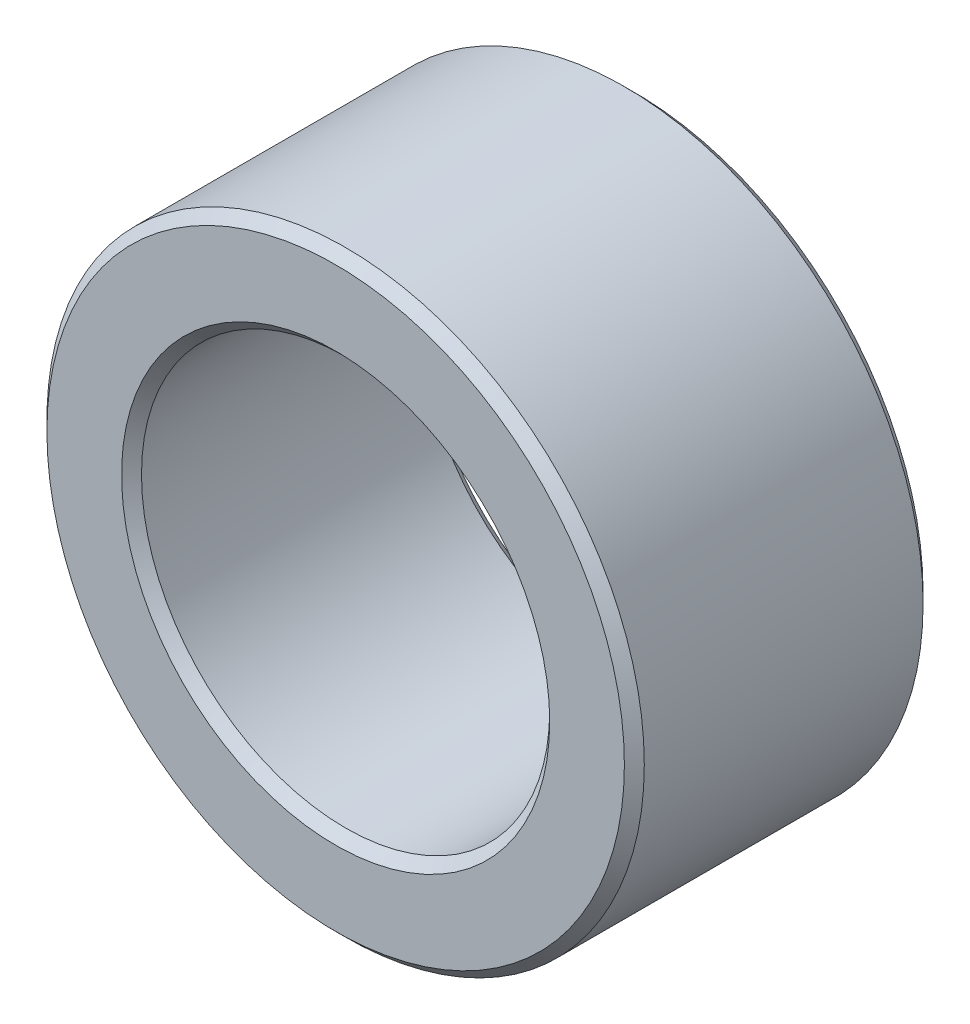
ISO-10303-21;
HEADER;
FILE_DESCRIPTION(('STEP AP214'),'2;1');
FILE_NAME('part.step','',(''),(''),'','','');
FILE_SCHEMA(('AUTOMOTIVE_DESIGN { 1 0 10303 214 1 1 1 1 }'));
ENDSEC;
DATA;
#1=APPLICATION_CONTEXT('core data for automotive mechanical design processes');
#2=APPLICATION_PROTOCOL_DEFINITION('international standard','automotive_design',2000,#1);
#3=PRODUCT_CONTEXT('',#1,'mechanical');
#4=PRODUCT('Part','Part','',(#3));
#5=PRODUCT_RELATED_PRODUCT_CATEGORY('part','',(#4));
#6=PRODUCT_DEFINITION_FORMATION('','',#4);
#7=PRODUCT_DEFINITION_CONTEXT('part definition',#1,'design');
#8=PRODUCT_DEFINITION('design','',#6,#7);
#9=PRODUCT_DEFINITION_SHAPE('','',#8);
#10=(LENGTH_UNIT() NAMED_UNIT(*) SI_UNIT(.MILLI.,.METRE.));
#11=(NAMED_UNIT(*) PLANE_ANGLE_UNIT() SI_UNIT($,.RADIAN.));
#12=(NAMED_UNIT(*) SI_UNIT($,.STERADIAN.) SOLID_ANGLE_UNIT());
#13=UNCERTAINTY_MEASURE_WITH_UNIT(LENGTH_MEASURE(1.E-05),#10,'distance_accuracy_value','');
#14=(GEOMETRIC_REPRESENTATION_CONTEXT(3) GLOBAL_UNCERTAINTY_ASSIGNED_CONTEXT((#13)) GLOBAL_UNIT_ASSIGNED_CONTEXT((#10,
#11,#12)) REPRESENTATION_CONTEXT('',''));
#15=CARTESIAN_POINT('',(0.,0.,0.));
#16=DIRECTION('',(0.,0.,1.));
#17=DIRECTION('',(1.,0.,0.));
#18=AXIS2_PLACEMENT_3D('',#15,#16,#17);
#19=CARTESIAN_POINT('',(0.,0.,3.));
#20=DIRECTION('',(0.,0.,1.));
#21=DIRECTION('',(1.,0.,0.));
#22=AXIS2_PLACEMENT_3D('',#19,#20,#21);
#23=PLANE('',#22);
#24=CARTESIAN_POINT('',(0.,0.,3.));
#25=DIRECTION('',(0.,0.,1.));
#26=DIRECTION('',(1.,0.,0.));
#27=AXIS2_PLACEMENT_3D('',#24,#25,#26);
#28=CIRCLE('',#27,4.3);
#29=CARTESIAN_POINT('',(4.3,0.,3.));
#30=VERTEX_POINT('',#29);
#31=EDGE_CURVE('E10',#30,#30,#28,.F.);
#32=ORIENTED_EDGE('',*,*,#31,.T.);
#33=EDGE_LOOP('',(#32));
#34=FACE_BOUND('',#33,.T.);
#35=CARTESIAN_POINT('',(0.,0.,3.));
#36=DIRECTION('',(0.,0.,1.));
#37=DIRECTION('',(1.,0.,0.));
#38=AXIS2_PLACEMENT_3D('',#35,#36,#37);
#39=CIRCLE('',#38,5.8);
#40=CARTESIAN_POINT('',(5.8,0.,3.));
#41=VERTEX_POINT('',#40);
#42=EDGE_CURVE('E45',#41,#41,#39,.T.);
#43=ORIENTED_EDGE('',*,*,#42,.T.);
#44=EDGE_LOOP('',(#43));
#45=FACE_BOUND('',#44,.T.);
#46=ADVANCED_FACE('F37',(#34,#45),#23,.T.);
#47=CARTESIAN_POINT('',(0.,0.,-3.));
#48=DIRECTION('',(0.,0.,1.));
#49=DIRECTION('',(1.,0.,0.));
#50=AXIS2_PLACEMENT_3D('',#47,#48,#49);
#51=PLANE('',#50);
#52=CARTESIAN_POINT('',(0.,0.,-3.));
#53=DIRECTION('',(0.,0.,1.));
#54=DIRECTION('',(1.,0.,0.));
#55=AXIS2_PLACEMENT_3D('',#52,#53,#54);
#56=CIRCLE('',#55,5.8);
#57=CARTESIAN_POINT('',(5.8,0.,-3.));
#58=VERTEX_POINT('',#57);
#59=EDGE_CURVE('E63',#58,#58,#56,.F.);
#60=ORIENTED_EDGE('',*,*,#59,.T.);
#61=EDGE_LOOP('',(#60));
#62=FACE_BOUND('',#61,.T.);
#63=CARTESIAN_POINT('',(0.,0.,-3.));
#64=DIRECTION('',(0.,0.,1.));
#65=DIRECTION('',(1.,0.,0.));
#66=AXIS2_PLACEMENT_3D('',#63,#64,#65);
#67=CIRCLE('',#66,4.3);
#68=CARTESIAN_POINT('',(-4.3,0.,-3.));
#69=VERTEX_POINT('',#68);
#70=EDGE_CURVE('E67',#69,#69,#67,.T.);
#71=ORIENTED_EDGE('',*,*,#70,.T.);
#72=EDGE_LOOP('',(#71));
#73=FACE_BOUND('',#72,.T.);
#74=ADVANCED_FACE('F89',(#62,#73),#51,.F.);
#75=CARTESIAN_POINT('',(0.,0.,3.));
#76=DIRECTION('',(0.,0.,-1.));
#77=DIRECTION('',(-1.,0.,0.));
#78=AXIS2_PLACEMENT_3D('',#75,#76,#77);
#79=CYLINDRICAL_SURFACE('',#78,6.);
#80=CARTESIAN_POINT('',(0.,0.,-2.8));
#81=DIRECTION('',(0.,0.,1.));
#82=DIRECTION('',(1.,0.,0.));
#83=AXIS2_PLACEMENT_3D('',#80,#81,#82);
#84=CIRCLE('',#83,6.);
#85=CARTESIAN_POINT('',(6.,0.,-2.8));
#86=VERTEX_POINT('',#85);
#87=EDGE_CURVE('E70',#86,#86,#84,.T.);
#88=ORIENTED_EDGE('',*,*,#87,.T.);
#89=EDGE_LOOP('',(#88));
#90=FACE_BOUND('',#89,.T.);
#91=CARTESIAN_POINT('',(0.,0.,2.8));
#92=DIRECTION('',(0.,0.,1.));
#93=DIRECTION('',(1.,0.,0.));
#94=AXIS2_PLACEMENT_3D('',#91,#92,#93);
#95=CIRCLE('',#94,6.);
#96=CARTESIAN_POINT('',(6.,0.,2.8));
#97=VERTEX_POINT('',#96);
#98=EDGE_CURVE('E74',#97,#97,#95,.F.);
#99=ORIENTED_EDGE('',*,*,#98,.T.);
#100=EDGE_LOOP('',(#99));
#101=FACE_BOUND('',#100,.T.);
#102=ADVANCED_FACE('F78',(#90,#101),#79,.T.);
#103=CARTESIAN_POINT('',(0.,0.,3.));
#104=DIRECTION('',(0.,0.,-1.));
#105=DIRECTION('',(-1.,0.,0.));
#106=AXIS2_PLACEMENT_3D('',#103,#104,#105);
#107=CYLINDRICAL_SURFACE('',#106,4.1);
#108=CARTESIAN_POINT('',(0.,0.,-2.8));
#109=DIRECTION('',(0.,0.,1.));
#110=DIRECTION('',(1.,0.,0.));
#111=AXIS2_PLACEMENT_3D('',#108,#109,#110);
#112=CIRCLE('',#111,4.1);
#113=CARTESIAN_POINT('',(-4.1,0.,-2.8));
#114=VERTEX_POINT('',#113);
#115=EDGE_CURVE('E52',#114,#114,#112,.F.);
#116=CARTESIAN_POINT('',(0.,0.,2.8));
#117=DIRECTION('',(0.,0.,1.));
#118=DIRECTION('',(1.,0.,0.));
#119=AXIS2_PLACEMENT_3D('',#116,#117,#118);
#120=CIRCLE('',#119,4.1);
#121=CARTESIAN_POINT('',(-4.1,0.,2.8));
#122=VERTEX_POINT('',#121);
#123=EDGE_CURVE('E58',#122,#122,#120,.T.);
#124=CARTESIAN_POINT('',(-4.1,0.,-2.8));
#125=CARTESIAN_POINT('',(-4.1,0.,-2.74166666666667));
#126=CARTESIAN_POINT('',(-4.1,0.,-2.68333333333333));
#127=CARTESIAN_POINT('',(-4.1,0.,-2.56666666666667));
#128=CARTESIAN_POINT('',(-4.1,0.,-2.50833333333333));
#129=CARTESIAN_POINT('',(-4.1,0.,-2.39166666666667));
#130=CARTESIAN_POINT('',(-4.1,0.,-2.33333333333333));
#131=CARTESIAN_POINT('',(-4.1,0.,-2.21666666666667));
#132=CARTESIAN_POINT('',(-4.1,0.,-2.15833333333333));
#133=CARTESIAN_POINT('',(-4.1,0.,-2.04166666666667));
#134=CARTESIAN_POINT('',(-4.1,0.,-1.98333333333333));
#135=CARTESIAN_POINT('',(-4.1,0.,-1.86666666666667));
#136=CARTESIAN_POINT('',(-4.1,0.,-1.80833333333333));
#137=CARTESIAN_POINT('',(-4.1,0.,-1.69166666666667));
#138=CARTESIAN_POINT('',(-4.1,0.,-1.63333333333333));
#139=CARTESIAN_POINT('',(-4.1,0.,-1.51666666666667));
#140=CARTESIAN_POINT('',(-4.1,0.,-1.45833333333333));
#141=CARTESIAN_POINT('',(-4.1,0.,-1.34166666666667));
#142=CARTESIAN_POINT('',(-4.1,0.,-1.28333333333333));
#143=CARTESIAN_POINT('',(-4.1,0.,-1.16666666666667));
#144=CARTESIAN_POINT('',(-4.1,0.,-1.10833333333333));
#145=CARTESIAN_POINT('',(-4.1,0.,-0.991666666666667));
#146=CARTESIAN_POINT('',(-4.1,0.,-0.933333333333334));
#147=CARTESIAN_POINT('',(-4.1,0.,-0.816666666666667));
#148=CARTESIAN_POINT('',(-4.1,0.,-0.758333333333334));
#149=CARTESIAN_POINT('',(-4.1,0.,-0.641666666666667));
#150=CARTESIAN_POINT('',(-4.1,0.,-0.583333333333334));
#151=CARTESIAN_POINT('',(-4.1,0.,-0.466666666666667));
#152=CARTESIAN_POINT('',(-4.1,0.,-0.408333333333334));
#153=CARTESIAN_POINT('',(-4.1,0.,-0.291666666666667));
#154=CARTESIAN_POINT('',(-4.1,0.,-0.233333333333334));
#155=CARTESIAN_POINT('',(-4.1,0.,-0.116666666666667));
#156=CARTESIAN_POINT('',(-4.1,0.,-0.0583333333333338));
#157=CARTESIAN_POINT('',(-4.1,0.,0.058333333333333));
#158=CARTESIAN_POINT('',(-4.1,0.,0.116666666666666));
#159=CARTESIAN_POINT('',(-4.1,0.,0.233333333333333));
#160=CARTESIAN_POINT('',(-4.1,0.,0.291666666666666));
#161=CARTESIAN_POINT('',(-4.1,0.,0.408333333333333));
#162=CARTESIAN_POINT('',(-4.1,0.,0.466666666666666));
#163=CARTESIAN_POINT('',(-4.1,0.,0.583333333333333));
#164=CARTESIAN_POINT('',(-4.1,0.,0.641666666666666));
#165=CARTESIAN_POINT('',(-4.1,0.,0.758333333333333));
#166=CARTESIAN_POINT('',(-4.1,0.,0.816666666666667));
#167=CARTESIAN_POINT('',(-4.1,0.,0.933333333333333));
#168=CARTESIAN_POINT('',(-4.1,0.,0.991666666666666));
#169=CARTESIAN_POINT('',(-4.1,0.,1.10833333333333));
#170=CARTESIAN_POINT('',(-4.1,0.,1.16666666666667));
#171=CARTESIAN_POINT('',(-4.1,0.,1.28333333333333));
#172=CARTESIAN_POINT('',(-4.1,0.,1.34166666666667));
#173=CARTESIAN_POINT('',(-4.1,0.,1.45833333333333));
#174=CARTESIAN_POINT('',(-4.1,0.,1.51666666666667));
#175=CARTESIAN_POINT('',(-4.1,0.,1.63333333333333));
#176=CARTESIAN_POINT('',(-4.1,0.,1.69166666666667));
#177=CARTESIAN_POINT('',(-4.1,0.,1.80833333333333));
#178=CARTESIAN_POINT('',(-4.1,0.,1.86666666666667));
#179=CARTESIAN_POINT('',(-4.1,0.,1.98333333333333));
#180=CARTESIAN_POINT('',(-4.1,0.,2.04166666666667));
#181=CARTESIAN_POINT('',(-4.1,0.,2.15833333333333));
#182=CARTESIAN_POINT('',(-4.1,0.,2.21666666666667));
#183=CARTESIAN_POINT('',(-4.1,0.,2.33333333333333));
#184=CARTESIAN_POINT('',(-4.1,0.,2.39166666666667));
#185=CARTESIAN_POINT('',(-4.1,0.,2.50833333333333));
#186=CARTESIAN_POINT('',(-4.1,0.,2.56666666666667));
#187=CARTESIAN_POINT('',(-4.1,0.,2.68333333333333));
#188=CARTESIAN_POINT('',(-4.1,0.,2.74166666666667));
#189=CARTESIAN_POINT('',(-4.1,0.,2.8));
#190=B_SPLINE_CURVE_WITH_KNOTS('',3,(#124,#125,#126,#127,#128,#129,#130,#131,#132,#133,#134,
#135,#136,#137,#138,#139,#140,#141,#142,#143,#144,#145,#146,#147,#148,#149,#150,#151,#152,#153,
#154,#155,#156,#157,#158,#159,#160,#161,#162,#163,#164,#165,#166,#167,#168,#169,#170,#171,#172,
#173,#174,#175,#176,#177,#178,#179,#180,#181,#182,#183,#184,#185,#186,#187,#188,#189),
.UNSPECIFIED.,.F.,.F.,(4,2,2,2,2,2,2,2,2,2,2,2,2,2,2,2,2,2,2,2,2,2,2,2,2,2,2,2,2,2,2,2,4),(0.,
0.175,0.35,0.525,0.7,0.875,1.05,1.225,1.4,1.575,1.75,1.925,2.1,2.275,2.45,2.625,2.8,2.975,3.15,
3.325,3.5,3.675,3.85,4.025,4.2,4.375,4.55,4.725,4.9,5.075,5.25,5.425,5.6),.UNSPECIFIED.);
#191=EDGE_CURVE('BSEAM97',#114,#122,#190,.T.);
#192=ORIENTED_EDGE('',*,*,#115,.T.);
#193=ORIENTED_EDGE('',*,*,#123,.T.);
#194=ORIENTED_EDGE('',*,*,#191,.T.);
#195=ORIENTED_EDGE('',*,*,#191,.F.);
#196=EDGE_LOOP('',(#192,#194,#193,#195));
#197=FACE_BOUND('',#196,.T.);
#198=ADVANCED_FACE('F97',(#197),#107,.F.);
#199=CARTESIAN_POINT('',(0.,0.,-2.8));
#200=DIRECTION('',(0.,0.,1.));
#201=DIRECTION('',(1.,0.,0.));
#202=AXIS2_PLACEMENT_3D('',#199,#200,#201);
#203=CONICAL_SURFACE('',#202,6.,0.785398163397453);
#204=ORIENTED_EDGE('',*,*,#59,.F.);
#205=EDGE_LOOP('',(#204));
#206=FACE_BOUND('',#205,.T.);
#207=ORIENTED_EDGE('',*,*,#87,.F.);
#208=EDGE_LOOP('',(#207));
#209=FACE_BOUND('',#208,.T.);
#210=ADVANCED_FACE('F102',(#206,#209),#203,.T.);
#211=CARTESIAN_POINT('',(0.,0.,-3.));
#212=DIRECTION('',(0.,0.,-1.));
#213=DIRECTION('',(-1.,0.,0.));
#214=AXIS2_PLACEMENT_3D('',#211,#212,#213);
#215=CONICAL_SURFACE('',#214,4.3,0.785398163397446);
#216=CARTESIAN_POINT('',(-4.1,0.,-2.8));
#217=CARTESIAN_POINT('',(-4.10208333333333,0.,-2.80208333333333));
#218=CARTESIAN_POINT('',(-4.10416666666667,0.,-2.80416666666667));
#219=CARTESIAN_POINT('',(-4.10833333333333,0.,-2.80833333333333));
#220=CARTESIAN_POINT('',(-4.11041666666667,0.,-2.81041666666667));
#221=CARTESIAN_POINT('',(-4.11458333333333,0.,-2.81458333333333));
#222=CARTESIAN_POINT('',(-4.11666666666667,0.,-2.81666666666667));
#223=CARTESIAN_POINT('',(-4.12083333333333,0.,-2.82083333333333));
#224=CARTESIAN_POINT('',(-4.12291666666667,0.,-2.82291666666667));
#225=CARTESIAN_POINT('',(-4.12708333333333,0.,-2.82708333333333));
#226=CARTESIAN_POINT('',(-4.12916666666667,0.,-2.82916666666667));
#227=CARTESIAN_POINT('',(-4.13333333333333,0.,-2.83333333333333));
#228=CARTESIAN_POINT('',(-4.13541666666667,0.,-2.83541666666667));
#229=CARTESIAN_POINT('',(-4.13958333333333,0.,-2.83958333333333));
#230=CARTESIAN_POINT('',(-4.14166666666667,0.,-2.84166666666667));
#231=CARTESIAN_POINT('',(-4.14583333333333,0.,-2.84583333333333));
#232=CARTESIAN_POINT('',(-4.14791666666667,0.,-2.84791666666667));
#233=CARTESIAN_POINT('',(-4.15208333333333,0.,-2.85208333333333));
#234=CARTESIAN_POINT('',(-4.15416666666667,0.,-2.85416666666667));
#235=CARTESIAN_POINT('',(-4.15833333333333,0.,-2.85833333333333));
#236=CARTESIAN_POINT('',(-4.16041666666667,0.,-2.86041666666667));
#237=CARTESIAN_POINT('',(-4.16458333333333,0.,-2.86458333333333));
#238=CARTESIAN_POINT('',(-4.16666666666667,0.,-2.86666666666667));
#239=CARTESIAN_POINT('',(-4.17083333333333,0.,-2.87083333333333));
#240=CARTESIAN_POINT('',(-4.17291666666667,0.,-2.87291666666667));
#241=CARTESIAN_POINT('',(-4.17708333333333,0.,-2.87708333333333));
#242=CARTESIAN_POINT('',(-4.17916666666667,0.,-2.87916666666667));
#243=CARTESIAN_POINT('',(-4.18333333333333,0.,-2.88333333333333));
#244=CARTESIAN_POINT('',(-4.18541666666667,0.,-2.88541666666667));
#245=CARTESIAN_POINT('',(-4.18958333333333,0.,-2.88958333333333));
#246=CARTESIAN_POINT('',(-4.19166666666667,0.,-2.89166666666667));
#247=CARTESIAN_POINT('',(-4.19583333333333,0.,-2.89583333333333));
#248=CARTESIAN_POINT('',(-4.19791666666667,0.,-2.89791666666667));
#249=CARTESIAN_POINT('',(-4.20208333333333,0.,-2.90208333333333));
#250=CARTESIAN_POINT('',(-4.20416666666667,0.,-2.90416666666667));
#251=CARTESIAN_POINT('',(-4.20833333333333,0.,-2.90833333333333));
#252=CARTESIAN_POINT('',(-4.21041666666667,0.,-2.91041666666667));
#253=CARTESIAN_POINT('',(-4.21458333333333,0.,-2.91458333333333));
#254=CARTESIAN_POINT('',(-4.21666666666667,0.,-2.91666666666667));
#255=CARTESIAN_POINT('',(-4.22083333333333,0.,-2.92083333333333));
#256=CARTESIAN_POINT('',(-4.22291666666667,0.,-2.92291666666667));
#257=CARTESIAN_POINT('',(-4.22708333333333,0.,-2.92708333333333));
#258=CARTESIAN_POINT('',(-4.22916666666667,0.,-2.92916666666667));
#259=CARTESIAN_POINT('',(-4.23333333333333,0.,-2.93333333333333));
#260=CARTESIAN_POINT('',(-4.23541666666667,0.,-2.93541666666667));
#261=CARTESIAN_POINT('',(-4.23958333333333,0.,-2.93958333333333));
#262=CARTESIAN_POINT('',(-4.24166666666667,0.,-2.94166666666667));
#263=CARTESIAN_POINT('',(-4.24583333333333,0.,-2.94583333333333));
#264=CARTESIAN_POINT('',(-4.24791666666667,0.,-2.94791666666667));
#265=CARTESIAN_POINT('',(-4.25208333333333,0.,-2.95208333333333));
#266=CARTESIAN_POINT('',(-4.25416666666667,0.,-2.95416666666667));
#267=CARTESIAN_POINT('',(-4.25833333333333,0.,-2.95833333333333));
#268=CARTESIAN_POINT('',(-4.26041666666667,0.,-2.96041666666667));
#269=CARTESIAN_POINT('',(-4.26458333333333,0.,-2.96458333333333));
#270=CARTESIAN_POINT('',(-4.26666666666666,0.,-2.96666666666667));
#271=CARTESIAN_POINT('',(-4.27083333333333,0.,-2.97083333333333));
#272=CARTESIAN_POINT('',(-4.27291666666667,0.,-2.97291666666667));
#273=CARTESIAN_POINT('',(-4.27708333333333,0.,-2.97708333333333));
#274=CARTESIAN_POINT('',(-4.27916666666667,0.,-2.97916666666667));
#275=CARTESIAN_POINT('',(-4.28333333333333,0.,-2.98333333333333));
#276=CARTESIAN_POINT('',(-4.28541666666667,0.,-2.98541666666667));
#277=CARTESIAN_POINT('',(-4.28958333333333,0.,-2.98958333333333));
#278=CARTESIAN_POINT('',(-4.29166666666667,0.,-2.99166666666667));
#279=CARTESIAN_POINT('',(-4.29583333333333,0.,-2.99583333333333));
#280=CARTESIAN_POINT('',(-4.29791666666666,0.,-2.99791666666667));
#281=CARTESIAN_POINT('',(-4.3,0.,-3.));
#282=B_SPLINE_CURVE_WITH_KNOTS('',3,(#216,#217,#218,#219,#220,#221,#222,#223,#224,#225,#226,
#227,#228,#229,#230,#231,#232,#233,#234,#235,#236,#237,#238,#239,#240,#241,#242,#243,#244,#245,
#246,#247,#248,#249,#250,#251,#252,#253,#254,#255,#256,#257,#258,#259,#260,#261,#262,#263,#264,
#265,#266,#267,#268,#269,#270,#271,#272,#273,#274,#275,#276,#277,#278,#279,#280,#281),
.UNSPECIFIED.,.F.,.F.,(4,2,2,2,2,2,2,2,2,2,2,2,2,2,2,2,2,2,2,2,2,2,2,2,2,2,2,2,2,2,2,2,4),(0.,
0.00883883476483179,0.0176776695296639,0.0265165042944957,0.0353553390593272,0.0441941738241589,
0.053033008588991,0.0618718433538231,0.0707106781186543,0.0795495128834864,0.0883883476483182,
0.0972271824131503,0.106066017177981,0.114904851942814,0.123743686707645,0.132582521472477,
0.141421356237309,0.150260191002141,0.159099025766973,0.167937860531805,0.176776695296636,
0.185615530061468,0.1944543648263,0.203293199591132,0.212132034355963,0.220970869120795,
0.229809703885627,0.238648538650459,0.247487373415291,0.256326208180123,0.265165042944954,
0.274003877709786,0.282842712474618),.UNSPECIFIED.);
#283=EDGE_CURVE('BSEAM86',#114,#69,#282,.T.);
#284=ORIENTED_EDGE('',*,*,#115,.F.);
#285=ORIENTED_EDGE('',*,*,#70,.F.);
#286=ORIENTED_EDGE('',*,*,#283,.T.);
#287=ORIENTED_EDGE('',*,*,#283,.F.);
#288=EDGE_LOOP('',(#284,#286,#285,#287));
#289=FACE_BOUND('',#288,.T.);
#290=ADVANCED_FACE('F86',(#289),#215,.F.);
#291=CARTESIAN_POINT('',(0.,0.,2.8));
#292=DIRECTION('',(0.,0.,1.));
#293=DIRECTION('',(1.,0.,0.));
#294=AXIS2_PLACEMENT_3D('',#291,#292,#293);
#295=CONICAL_SURFACE('',#294,4.1,0.78539816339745);
#296=ORIENTED_EDGE('',*,*,#31,.F.);
#297=EDGE_LOOP('',(#296));
#298=FACE_BOUND('',#297,.T.);
#299=ORIENTED_EDGE('',*,*,#123,.F.);
#300=EDGE_LOOP('',(#299));
#301=FACE_BOUND('',#300,.T.);
#302=ADVANCED_FACE('F82',(#298,#301),#295,.F.);
#303=CARTESIAN_POINT('',(0.,0.,3.));
#304=DIRECTION('',(0.,0.,-1.));
#305=DIRECTION('',(-1.,0.,0.));
#306=AXIS2_PLACEMENT_3D('',#303,#304,#305);
#307=CONICAL_SURFACE('',#306,5.8,0.785398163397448);
#308=ORIENTED_EDGE('',*,*,#98,.F.);
#309=EDGE_LOOP('',(#308));
#310=FACE_BOUND('',#309,.T.);
#311=ORIENTED_EDGE('',*,*,#42,.F.);
#312=EDGE_LOOP('',(#311));
#313=FACE_BOUND('',#312,.T.);
#314=ADVANCED_FACE('F39',(#310,#313),#307,.T.);
#315=CLOSED_SHELL('',(#46,#74,#102,#198,#210,#290,#302,#314));
#316=MANIFOLD_SOLID_BREP('B2',#315);
#317=ADVANCED_BREP_SHAPE_REPRESENTATION('',(#18,#316),#14);
#318=SHAPE_DEFINITION_REPRESENTATION(#9,#317);
ENDSEC;
END-ISO-10303-21;
